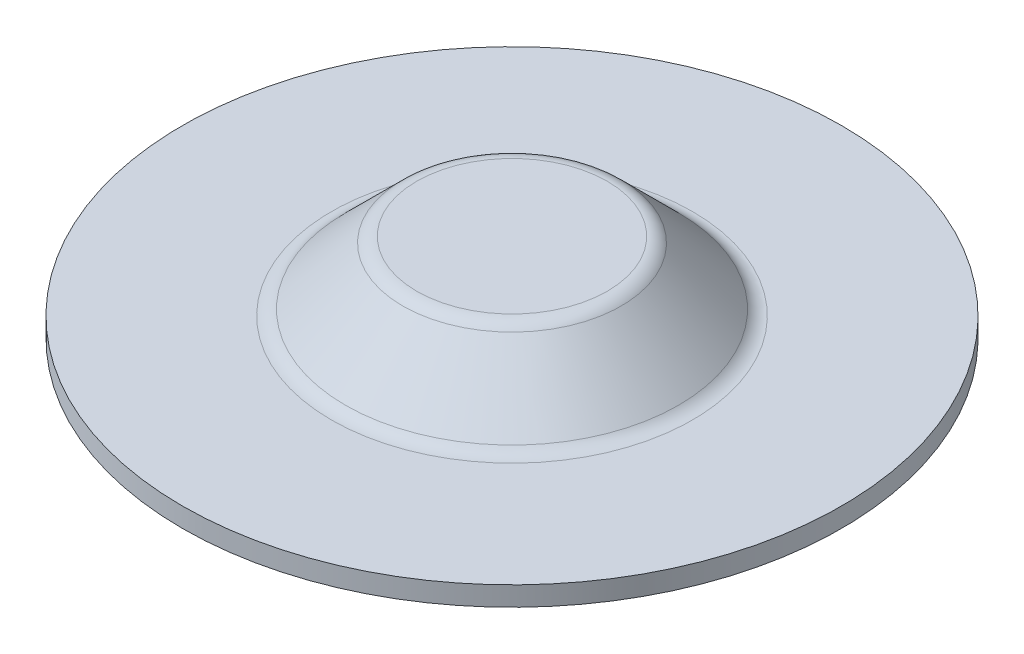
ISO-10303-21;
HEADER;
FILE_DESCRIPTION(('STEP AP214'),'2;1');
FILE_NAME('part.step','',(''),(''),'','','');
FILE_SCHEMA(('AUTOMOTIVE_DESIGN { 1 0 10303 214 1 1 1 1 }'));
ENDSEC;
DATA;
#1=APPLICATION_CONTEXT('core data for automotive mechanical design processes');
#2=APPLICATION_PROTOCOL_DEFINITION('international standard','automotive_design',2000,#1);
#3=PRODUCT_CONTEXT('',#1,'mechanical');
#4=PRODUCT('Part','Part','',(#3));
#5=PRODUCT_RELATED_PRODUCT_CATEGORY('part','',(#4));
#6=PRODUCT_DEFINITION_FORMATION('','',#4);
#7=PRODUCT_DEFINITION_CONTEXT('part definition',#1,'design');
#8=PRODUCT_DEFINITION('design','',#6,#7);
#9=PRODUCT_DEFINITION_SHAPE('','',#8);
#10=(LENGTH_UNIT() NAMED_UNIT(*) SI_UNIT(.MILLI.,.METRE.));
#11=(NAMED_UNIT(*) PLANE_ANGLE_UNIT() SI_UNIT($,.RADIAN.));
#12=(NAMED_UNIT(*) SI_UNIT($,.STERADIAN.) SOLID_ANGLE_UNIT());
#13=UNCERTAINTY_MEASURE_WITH_UNIT(LENGTH_MEASURE(1.E-05),#10,'distance_accuracy_value','');
#14=(GEOMETRIC_REPRESENTATION_CONTEXT(3) GLOBAL_UNCERTAINTY_ASSIGNED_CONTEXT((#13)) GLOBAL_UNIT_ASSIGNED_CONTEXT((#10,
#11,#12)) REPRESENTATION_CONTEXT('',''));
#15=CARTESIAN_POINT('',(0.,0.,0.));
#16=DIRECTION('',(0.,0.,1.));
#17=DIRECTION('',(1.,0.,0.));
#18=AXIS2_PLACEMENT_3D('',#15,#16,#17);
#19=CARTESIAN_POINT('',(0.,0.,0.));
#20=DIRECTION('',(0.,-1.,0.));
#21=DIRECTION('',(0.,0.,-1.));
#22=AXIS2_PLACEMENT_3D('',#19,#20,#21);
#23=PLANE('',#22);
#24=CARTESIAN_POINT('',(0.,0.,0.));
#25=DIRECTION('',(0.,-1.,0.));
#26=DIRECTION('',(0.,0.,1.));
#27=AXIS2_PLACEMENT_3D('',#24,#25,#26);
#28=CIRCLE('',#27,7.3443385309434);
#29=CARTESIAN_POINT('',(0.,0.,7.3443385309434));
#30=VERTEX_POINT('',#29);
#31=CARTESIAN_POINT('',(0.,0.,-7.3443385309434));
#32=VERTEX_POINT('',#31);
#33=EDGE_CURVE('E55',#30,#32,#28,.T.);
#34=ORIENTED_EDGE('',*,*,#33,.F.);
#35=CARTESIAN_POINT('',(0.,0.,0.));
#36=DIRECTION('',(0.,-1.,0.));
#37=DIRECTION('',(0.,0.,-1.));
#38=AXIS2_PLACEMENT_3D('',#35,#36,#37);
#39=CIRCLE('',#38,7.3443385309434);
#40=EDGE_CURVE('E57',#32,#30,#39,.T.);
#41=ORIENTED_EDGE('',*,*,#40,.F.);
#42=EDGE_LOOP('',(#34,#41));
#43=FACE_BOUND('',#42,.T.);
#44=ADVANCED_FACE('F18',(#43),#23,.F.);
#45=CARTESIAN_POINT('',(0.,-1.524,0.));
#46=DIRECTION('',(0.,1.,0.));
#47=DIRECTION('',(0.,0.,1.));
#48=AXIS2_PLACEMENT_3D('',#45,#46,#47);
#49=TOROIDAL_SURFACE('',#48,7.3443385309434,1.524);
#50=ORIENTED_EDGE('',*,*,#33,.T.);
#51=ORIENTED_EDGE('',*,*,#40,.T.);
#52=EDGE_LOOP('',(#50,#51));
#53=FACE_BOUND('',#52,.T.);
#54=CARTESIAN_POINT('',(0.,-0.446369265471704,0.));
#55=DIRECTION('',(0.,-1.,0.));
#56=DIRECTION('',(0.,0.,-1.));
#57=AXIS2_PLACEMENT_3D('',#54,#55,#56);
#58=CIRCLE('',#57,8.4219692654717);
#59=CARTESIAN_POINT('',(0.,-0.446369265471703,-8.4219692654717));
#60=VERTEX_POINT('',#59);
#61=EDGE_CURVE('E63',#60,#60,#58,.T.);
#62=ORIENTED_EDGE('',*,*,#61,.F.);
#63=EDGE_LOOP('',(#62));
#64=FACE_BOUND('',#63,.T.);
#65=ADVANCED_FACE('F59',(#53,#64),#49,.T.);
#66=CARTESIAN_POINT('',(0.,-4.8622307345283,0.));
#67=DIRECTION('',(0.,-1.,0.));
#68=DIRECTION('',(0.,0.,-1.));
#69=AXIS2_PLACEMENT_3D('',#66,#67,#68);
#70=CONICAL_SURFACE('',#69,12.8378307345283,0.785398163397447);
#71=CARTESIAN_POINT('',(0.,-4.86223073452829,0.));
#72=DIRECTION('',(0.,1.,0.));
#73=DIRECTION('',(0.,0.,1.));
#74=AXIS2_PLACEMENT_3D('',#71,#72,#73);
#75=CIRCLE('',#74,12.8378307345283);
#76=CARTESIAN_POINT('',(0.,-4.86223073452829,12.8378307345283));
#77=VERTEX_POINT('',#76);
#78=EDGE_CURVE('E221',#77,#77,#75,.T.);
#79=ORIENTED_EDGE('',*,*,#78,.T.);
#80=EDGE_LOOP('',(#79));
#81=FACE_BOUND('',#80,.T.);
#82=ORIENTED_EDGE('',*,*,#61,.T.);
#83=EDGE_LOOP('',(#82));
#84=FACE_BOUND('',#83,.T.);
#85=ADVANCED_FACE('F89',(#81,#84),#70,.T.);
#86=CARTESIAN_POINT('',(0.,-1.4986,0.));
#87=DIRECTION('',(0.,1.,0.));
#88=DIRECTION('',(0.,0.,1.));
#89=AXIS2_PLACEMENT_3D('',#86,#87,#88);
#90=PLANE('',#89);
#91=CARTESIAN_POINT('',(0.,-1.4986,0.));
#92=DIRECTION('',(0.,1.,0.));
#93=DIRECTION('',(0.,0.,-1.));
#94=AXIS2_PLACEMENT_3D('',#91,#92,#93);
#95=CIRCLE('',#94,7.3443385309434);
#96=CARTESIAN_POINT('',(0.,-1.4986,7.3443385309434));
#97=VERTEX_POINT('',#96);
#98=CARTESIAN_POINT('',(0.,-1.4986,-7.3443385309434));
#99=VERTEX_POINT('',#98);
#100=EDGE_CURVE('E217',#97,#99,#95,.F.);
#101=ORIENTED_EDGE('',*,*,#100,.T.);
#102=CARTESIAN_POINT('',(0.,-1.4986,0.));
#103=DIRECTION('',(0.,1.,0.));
#104=DIRECTION('',(0.,0.,1.));
#105=AXIS2_PLACEMENT_3D('',#102,#103,#104);
#106=CIRCLE('',#105,7.3443385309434);
#107=EDGE_CURVE('E215',#99,#97,#106,.F.);
#108=ORIENTED_EDGE('',*,*,#107,.T.);
#109=EDGE_LOOP('',(#101,#108));
#110=FACE_BOUND('',#109,.T.);
#111=ADVANCED_FACE('F191',(#110),#90,.F.);
#112=CARTESIAN_POINT('',(0.,-3.7846,0.));
#113=DIRECTION('',(0.,1.,0.));
#114=DIRECTION('',(0.,0.,1.));
#115=AXIS2_PLACEMENT_3D('',#112,#113,#114);
#116=TOROIDAL_SURFACE('',#115,13.9154614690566,1.524);
#117=ORIENTED_EDGE('',*,*,#78,.F.);
#118=EDGE_LOOP('',(#117));
#119=FACE_BOUND('',#118,.T.);
#120=CARTESIAN_POINT('',(0.,-5.3086,0.));
#121=DIRECTION('',(0.,1.,0.));
#122=DIRECTION('',(0.,0.,-1.));
#123=AXIS2_PLACEMENT_3D('',#120,#121,#122);
#124=CIRCLE('',#123,13.9154614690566);
#125=CARTESIAN_POINT('',(0.,-5.3086,-13.9154614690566));
#126=VERTEX_POINT('',#125);
#127=CARTESIAN_POINT('',(0.,-5.3086,13.9154614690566));
#128=VERTEX_POINT('',#127);
#129=EDGE_CURVE('E150',#126,#128,#124,.T.);
#130=ORIENTED_EDGE('',*,*,#129,.T.);
#131=CARTESIAN_POINT('',(0.,-5.3086,0.));
#132=DIRECTION('',(0.,1.,0.));
#133=DIRECTION('',(0.,0.,1.));
#134=AXIS2_PLACEMENT_3D('',#131,#132,#133);
#135=CIRCLE('',#134,13.9154614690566);
#136=EDGE_CURVE('E182',#128,#126,#135,.T.);
#137=ORIENTED_EDGE('',*,*,#136,.T.);
#138=EDGE_LOOP('',(#130,#137));
#139=FACE_BOUND('',#138,.T.);
#140=ADVANCED_FACE('F188',(#119,#139),#116,.F.);
#141=CARTESIAN_POINT('',(0.,-1.524,0.));
#142=DIRECTION('',(0.,1.,0.));
#143=DIRECTION('',(0.,0.,1.));
#144=AXIS2_PLACEMENT_3D('',#141,#142,#143);
#145=TOROIDAL_SURFACE('',#144,7.3443385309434,0.0254000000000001);
#146=CARTESIAN_POINT('',(0.,-1.50603948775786,0.));
#147=DIRECTION('',(0.,-1.,0.));
#148=DIRECTION('',(0.,0.,-1.));
#149=AXIS2_PLACEMENT_3D('',#146,#147,#148);
#150=CIRCLE('',#149,7.36229904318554);
#151=CARTESIAN_POINT('',(0.,-1.50603948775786,-7.36229904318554));
#152=VERTEX_POINT('',#151);
#153=EDGE_CURVE('E107',#152,#152,#150,.T.);
#154=ORIENTED_EDGE('',*,*,#153,.T.);
#155=EDGE_LOOP('',(#154));
#156=FACE_BOUND('',#155,.T.);
#157=ORIENTED_EDGE('',*,*,#100,.F.);
#158=ORIENTED_EDGE('',*,*,#107,.F.);
#159=EDGE_LOOP('',(#157,#158));
#160=FACE_BOUND('',#159,.T.);
#161=ADVANCED_FACE('F167',(#156,#160),#145,.F.);
#162=CARTESIAN_POINT('',(13.9154614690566,-5.3086,0.));
#163=DIRECTION('',(0.,-1.,0.));
#164=DIRECTION('',(0.,0.,-1.));
#165=AXIS2_PLACEMENT_3D('',#162,#163,#164);
#166=PLANE('',#165);
#167=CARTESIAN_POINT('',(0.,-5.3086,0.));
#168=DIRECTION('',(0.,1.,0.));
#169=DIRECTION('',(0.,0.,1.));
#170=AXIS2_PLACEMENT_3D('',#167,#168,#169);
#171=CIRCLE('',#170,25.4);
#172=CARTESIAN_POINT('',(0.,-5.3086,25.4));
#173=VERTEX_POINT('',#172);
#174=EDGE_CURVE('E104',#173,#173,#171,.F.);
#175=ORIENTED_EDGE('',*,*,#174,.F.);
#176=EDGE_LOOP('',(#175));
#177=FACE_BOUND('',#176,.T.);
#178=ORIENTED_EDGE('',*,*,#129,.F.);
#179=ORIENTED_EDGE('',*,*,#136,.F.);
#180=EDGE_LOOP('',(#178,#179));
#181=FACE_BOUND('',#180,.T.);
#182=ADVANCED_FACE('F157',(#177,#181),#166,.F.);
#183=CARTESIAN_POINT('',(0.,-5.92190095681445,0.));
#184=DIRECTION('',(0.,-1.,0.));
#185=DIRECTION('',(1.,0.,0.));
#186=AXIS2_PLACEMENT_3D('',#183,#184,#185);
#187=CONICAL_SURFACE('',#186,11.7781605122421,0.785398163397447);
#188=ORIENTED_EDGE('',*,*,#153,.F.);
#189=EDGE_LOOP('',(#188));
#190=FACE_BOUND('',#189,.T.);
#191=CARTESIAN_POINT('',(0.,-5.92190095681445,0.));
#192=DIRECTION('',(0.,1.,0.));
#193=DIRECTION('',(0.,0.,1.));
#194=AXIS2_PLACEMENT_3D('',#191,#192,#193);
#195=CIRCLE('',#194,11.7781605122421);
#196=CARTESIAN_POINT('',(0.,-5.92190095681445,11.7781605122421));
#197=VERTEX_POINT('',#196);
#198=EDGE_CURVE('E103',#197,#197,#195,.T.);
#199=ORIENTED_EDGE('',*,*,#198,.F.);
#200=EDGE_LOOP('',(#199));
#201=FACE_BOUND('',#200,.T.);
#202=ADVANCED_FACE('F166',(#190,#201),#187,.F.);
#203=CARTESIAN_POINT('',(0.,0.,0.));
#204=DIRECTION('',(0.,1.,0.));
#205=DIRECTION('',(0.,0.,1.));
#206=AXIS2_PLACEMENT_3D('',#203,#204,#205);
#207=CYLINDRICAL_SURFACE('',#206,25.4);
#208=ORIENTED_EDGE('',*,*,#174,.T.);
#209=EDGE_LOOP('',(#208));
#210=FACE_BOUND('',#209,.T.);
#211=CARTESIAN_POINT('',(0.,-6.8072,0.));
#212=DIRECTION('',(0.,1.,0.));
#213=DIRECTION('',(0.,0.,1.));
#214=AXIS2_PLACEMENT_3D('',#211,#212,#213);
#215=CIRCLE('',#214,25.4);
#216=CARTESIAN_POINT('',(0.,-6.8072,25.4));
#217=VERTEX_POINT('',#216);
#218=EDGE_CURVE('E95',#217,#217,#215,.T.);
#219=ORIENTED_EDGE('',*,*,#218,.T.);
#220=EDGE_LOOP('',(#219));
#221=FACE_BOUND('',#220,.T.);
#222=ADVANCED_FACE('F127',(#210,#221),#207,.T.);
#223=CARTESIAN_POINT('',(0.,-3.7846,0.));
#224=DIRECTION('',(0.,1.,0.));
#225=DIRECTION('',(0.,0.,1.));
#226=AXIS2_PLACEMENT_3D('',#223,#224,#225);
#227=TOROIDAL_SURFACE('',#226,13.9154614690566,3.0226);
#228=CARTESIAN_POINT('',(0.,-6.8072,0.));
#229=DIRECTION('',(0.,-1.,0.));
#230=DIRECTION('',(0.,0.,1.));
#231=AXIS2_PLACEMENT_3D('',#228,#229,#230);
#232=CIRCLE('',#231,13.9154614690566);
#233=CARTESIAN_POINT('',(0.,-6.8072,13.9154614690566));
#234=VERTEX_POINT('',#233);
#235=CARTESIAN_POINT('',(0.,-6.8072,-13.9154614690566));
#236=VERTEX_POINT('',#235);
#237=EDGE_CURVE('E29',#234,#236,#232,.T.);
#238=ORIENTED_EDGE('',*,*,#237,.T.);
#239=CARTESIAN_POINT('',(0.,-6.8072,0.));
#240=DIRECTION('',(0.,-1.,0.));
#241=DIRECTION('',(0.,0.,-1.));
#242=AXIS2_PLACEMENT_3D('',#239,#240,#241);
#243=CIRCLE('',#242,13.9154614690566);
#244=EDGE_CURVE('E11',#236,#234,#243,.T.);
#245=ORIENTED_EDGE('',*,*,#244,.T.);
#246=EDGE_LOOP('',(#238,#245));
#247=FACE_BOUND('',#246,.T.);
#248=ORIENTED_EDGE('',*,*,#198,.T.);
#249=EDGE_LOOP('',(#248));
#250=FACE_BOUND('',#249,.T.);
#251=ADVANCED_FACE('F115',(#247,#250),#227,.T.);
#252=CARTESIAN_POINT('',(13.9154614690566,-6.8072,0.));
#253=DIRECTION('',(0.,1.,0.));
#254=DIRECTION('',(0.,0.,1.));
#255=AXIS2_PLACEMENT_3D('',#252,#253,#254);
#256=PLANE('',#255);
#257=ORIENTED_EDGE('',*,*,#237,.F.);
#258=ORIENTED_EDGE('',*,*,#244,.F.);
#259=EDGE_LOOP('',(#257,#258));
#260=FACE_BOUND('',#259,.T.);
#261=ORIENTED_EDGE('',*,*,#218,.F.);
#262=EDGE_LOOP('',(#261));
#263=FACE_BOUND('',#262,.T.);
#264=ADVANCED_FACE('F126',(#260,#263),#256,.F.);
#265=CLOSED_SHELL('',(#44,#65,#85,#111,#140,#161,#182,#202,#222,#251,#264));
#266=MANIFOLD_SOLID_BREP('B1',#265);
#267=ADVANCED_BREP_SHAPE_REPRESENTATION('',(#18,#266),#14);
#268=SHAPE_DEFINITION_REPRESENTATION(#9,#267);
ENDSEC;
END-ISO-10303-21;
